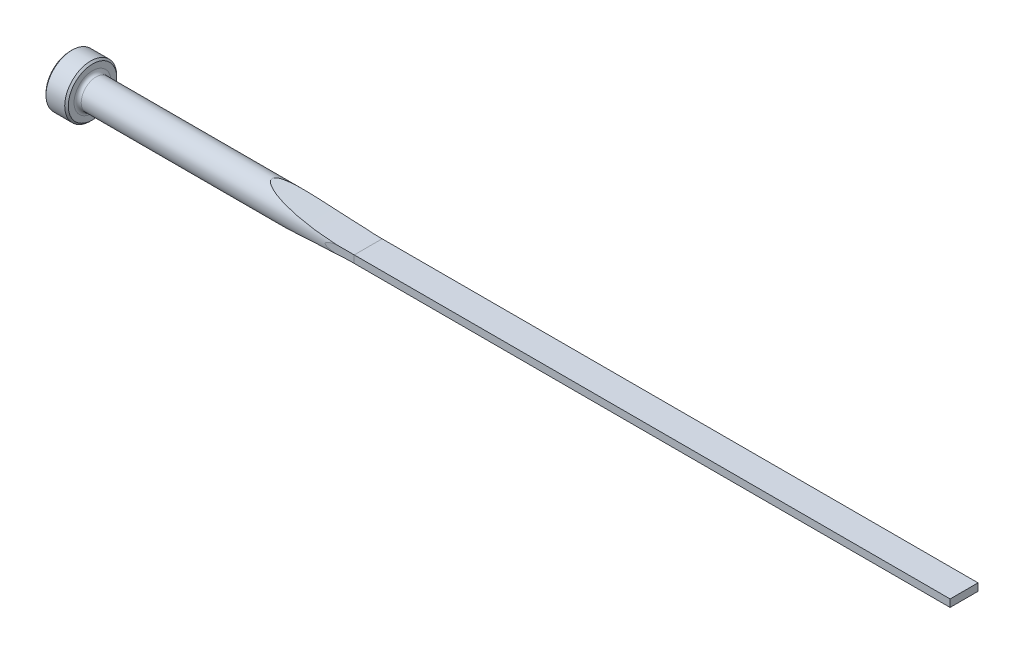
from build123d import *

# Parameters (mm, degrees)
CUT_EXTRUDE1_DEPTH = 191.661618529
CUT_EXTRUDE2_DEPTH = 191.661618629
FILLET1_R          = 0.762
CHAMFER1_SIZE      = 0.381


with BuildPart() as part:
    # Sketch1 → Revolve1 (revolve)
    with BuildSketch(Plane.XY, mode=Mode.PRIVATE) as revolve1_sk:
        Polygon((0, 0), (0, 5.5499), (4.7498, 5.5499), (4.7498, 3.175), (190.5, 3.175), (190.5, 0), align=None)
    revolve(revolve1_sk.sketch.rotate(Axis((0, 0, 0), (1, 0, 0)), 90), axis=Axis((0, 0, 0), (1, 0, 0)))

    # Sketch2 → Cut-Extrude1 (cut, symmetric)
    with BuildSketch(Plane.XY):
        with BuildLine():
            Line((190.5, 3.175), (190.5, 0.7874))
            Line((190.5, 0.7874), (63.5, 0.7874))
            ThreePointArc((63.5, 0.7874), (53.198115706, 1.386317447), (43.035038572, 3.175))
            Line((43.035038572, 3.175), (190.5, 3.175))
        make_face()
    cut_extrude1 = extrude(amount=CUT_EXTRUDE1_DEPTH, both=True, mode=Mode.SUBTRACT)

    # Mirror1: Cut-Extrude1 across plane
    add(cut_extrude1.mirror(Plane.ZX), mode=Mode.SUBTRACT)

    # Sketch3 → Cut-Extrude2 (cut, symmetric)
    with BuildSketch(Plane(origin=(0, 0, 0), x_dir=(1, 0, 0), z_dir=(0, 1, 0))):
        with BuildLine():
            Line((190.5, 3.175), (190.5, 2.9718))
            Line((190.5, 2.9718), (63.5, 2.9718))
            ThreePointArc((63.5, 2.9718), (60.49463147, 3.022614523), (57.492698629, 3.175))
            Line((57.492698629, 3.175), (190.5, 3.175))
        make_face()
    cut_extrude2 = extrude(amount=CUT_EXTRUDE2_DEPTH, both=True, mode=Mode.SUBTRACT)

    # Mirror2: Cut-Extrude2 across plane
    add(cut_extrude2.mirror(Plane.XY), mode=Mode.SUBTRACT)

    # Fillet1
    fillet1_edges = [part.edges().sort_by_distance(p)[0] for p in [
        (4.7498, 0, -3.175),
    ]]
    fillet(fillet1_edges, radius=FILLET1_R)

    # Chamfer1
    chamfer1_edges = [part.edges().sort_by_distance(p)[0] for p in [
        (4.7498, 0, -5.5499),
        (0, 0, -5.5499),
    ]]
    chamfer(chamfer1_edges, length=CHAMFER1_SIZE)


solid = part.part
